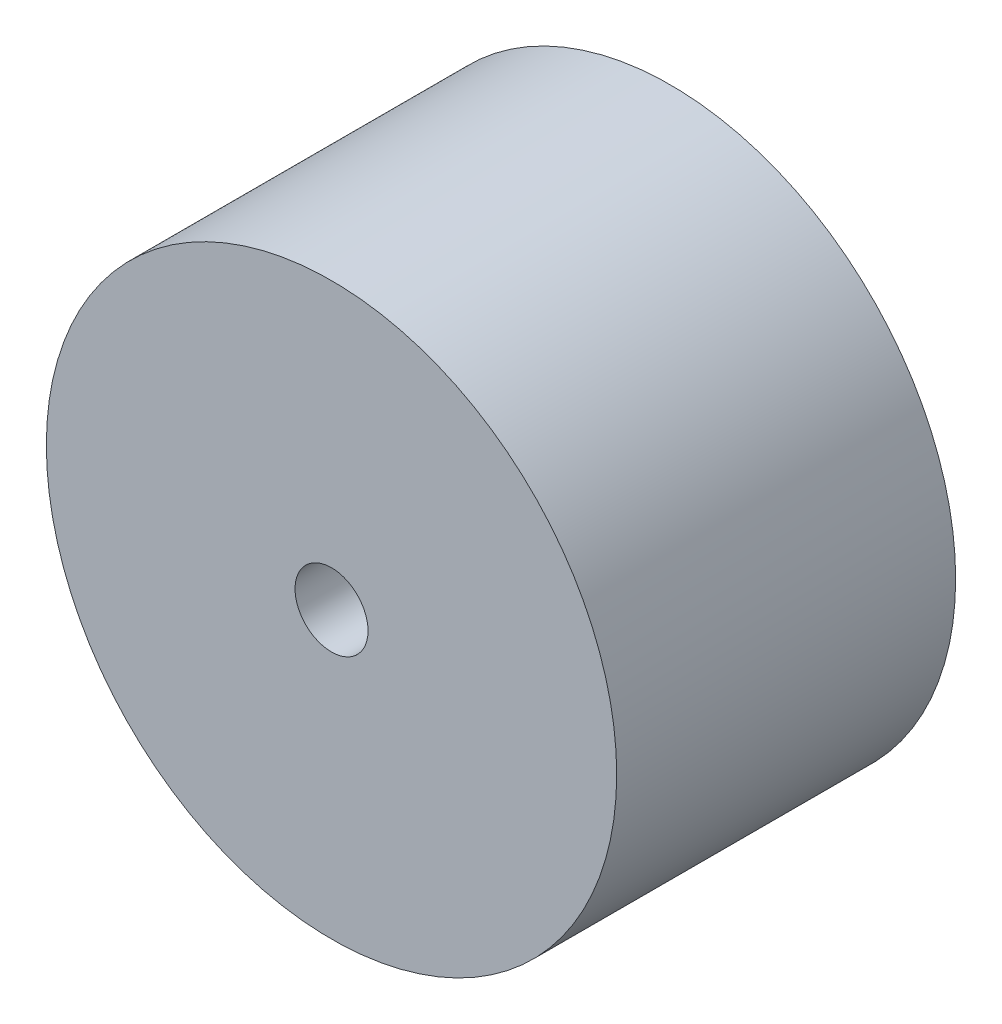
ISO-10303-21;
HEADER;
FILE_DESCRIPTION(('STEP AP214'),'2;1');
FILE_NAME('part.step','',(''),(''),'','','');
FILE_SCHEMA(('AUTOMOTIVE_DESIGN { 1 0 10303 214 1 1 1 1 }'));
ENDSEC;
DATA;
#1=APPLICATION_CONTEXT('core data for automotive mechanical design processes');
#2=APPLICATION_PROTOCOL_DEFINITION('international standard','automotive_design',2000,#1);
#3=PRODUCT_CONTEXT('',#1,'mechanical');
#4=PRODUCT('Part','Part','',(#3));
#5=PRODUCT_RELATED_PRODUCT_CATEGORY('part','',(#4));
#6=PRODUCT_DEFINITION_FORMATION('','',#4);
#7=PRODUCT_DEFINITION_CONTEXT('part definition',#1,'design');
#8=PRODUCT_DEFINITION('design','',#6,#7);
#9=PRODUCT_DEFINITION_SHAPE('','',#8);
#10=(LENGTH_UNIT() NAMED_UNIT(*) SI_UNIT(.MILLI.,.METRE.));
#11=(NAMED_UNIT(*) PLANE_ANGLE_UNIT() SI_UNIT($,.RADIAN.));
#12=(NAMED_UNIT(*) SI_UNIT($,.STERADIAN.) SOLID_ANGLE_UNIT());
#13=UNCERTAINTY_MEASURE_WITH_UNIT(LENGTH_MEASURE(1.E-05),#10,'distance_accuracy_value','');
#14=(GEOMETRIC_REPRESENTATION_CONTEXT(3) GLOBAL_UNCERTAINTY_ASSIGNED_CONTEXT((#13)) GLOBAL_UNIT_ASSIGNED_CONTEXT((#10,
#11,#12)) REPRESENTATION_CONTEXT('',''));
#15=CARTESIAN_POINT('',(0.,0.,0.));
#16=DIRECTION('',(0.,0.,1.));
#17=DIRECTION('',(1.,0.,0.));
#18=AXIS2_PLACEMENT_3D('',#15,#16,#17);
#19=CARTESIAN_POINT('',(0.,0.,29.7137));
#20=DIRECTION('',(0.,0.,1.));
#21=DIRECTION('',(1.,0.,0.));
#22=AXIS2_PLACEMENT_3D('',#19,#20,#21);
#23=PLANE('',#22);
#24=CARTESIAN_POINT('',(0.,0.,29.7137));
#25=DIRECTION('',(0.,0.,1.));
#26=DIRECTION('',(1.,0.,0.));
#27=AXIS2_PLACEMENT_3D('',#24,#25,#26);
#28=CIRCLE('',#27,25.);
#29=CARTESIAN_POINT('',(25.,0.,29.7137));
#30=VERTEX_POINT('',#29);
#31=EDGE_CURVE('E10',#30,#30,#28,.T.);
#32=ORIENTED_EDGE('',*,*,#31,.T.);
#33=EDGE_LOOP('',(#32));
#34=FACE_BOUND('',#33,.T.);
#35=CARTESIAN_POINT('',(0.,0.,29.7137));
#36=DIRECTION('',(0.,0.,1.));
#37=DIRECTION('',(1.,0.,0.));
#38=AXIS2_PLACEMENT_3D('',#35,#36,#37);
#39=CIRCLE('',#38,3.2);
#40=CARTESIAN_POINT('',(3.2,0.,29.7137));
#41=VERTEX_POINT('',#40);
#42=EDGE_CURVE('E50',#41,#41,#39,.T.);
#43=ORIENTED_EDGE('',*,*,#42,.F.);
#44=EDGE_LOOP('',(#43));
#45=FACE_BOUND('',#44,.T.);
#46=ADVANCED_FACE('F39',(#34,#45),#23,.T.);
#47=CARTESIAN_POINT('',(0.,0.,0.));
#48=DIRECTION('',(0.,0.,1.));
#49=DIRECTION('',(1.,0.,0.));
#50=AXIS2_PLACEMENT_3D('',#47,#48,#49);
#51=PLANE('',#50);
#52=CARTESIAN_POINT('',(0.,0.,0.));
#53=DIRECTION('',(0.,0.,1.));
#54=DIRECTION('',(1.,0.,0.));
#55=AXIS2_PLACEMENT_3D('',#52,#53,#54);
#56=CIRCLE('',#55,25.);
#57=CARTESIAN_POINT('',(25.,0.,0.));
#58=VERTEX_POINT('',#57);
#59=EDGE_CURVE('E43',#58,#58,#56,.T.);
#60=ORIENTED_EDGE('',*,*,#59,.F.);
#61=EDGE_LOOP('',(#60));
#62=FACE_BOUND('',#61,.T.);
#63=CARTESIAN_POINT('',(0.,0.,0.));
#64=DIRECTION('',(0.,0.,1.));
#65=DIRECTION('',(1.,0.,0.));
#66=AXIS2_PLACEMENT_3D('',#63,#64,#65);
#67=CIRCLE('',#66,3.2);
#68=CARTESIAN_POINT('',(3.2,0.,0.));
#69=VERTEX_POINT('',#68);
#70=EDGE_CURVE('E52',#69,#69,#67,.T.);
#71=ORIENTED_EDGE('',*,*,#70,.T.);
#72=EDGE_LOOP('',(#71));
#73=FACE_BOUND('',#72,.T.);
#74=ADVANCED_FACE('F62',(#62,#73),#51,.F.);
#75=CARTESIAN_POINT('',(0.,0.,29.7137));
#76=DIRECTION('',(0.,0.,-1.));
#77=DIRECTION('',(-1.,0.,0.));
#78=AXIS2_PLACEMENT_3D('',#75,#76,#77);
#79=CYLINDRICAL_SURFACE('',#78,25.);
#80=ORIENTED_EDGE('',*,*,#31,.F.);
#81=EDGE_LOOP('',(#80));
#82=FACE_BOUND('',#81,.T.);
#83=ORIENTED_EDGE('',*,*,#59,.T.);
#84=EDGE_LOOP('',(#83));
#85=FACE_BOUND('',#84,.T.);
#86=ADVANCED_FACE('F41',(#82,#85),#79,.T.);
#87=CARTESIAN_POINT('',(0.,0.,29.7137));
#88=DIRECTION('',(0.,0.,-1.));
#89=DIRECTION('',(-1.,0.,0.));
#90=AXIS2_PLACEMENT_3D('',#87,#88,#89);
#91=CYLINDRICAL_SURFACE('',#90,3.2);
#92=ORIENTED_EDGE('',*,*,#42,.T.);
#93=EDGE_LOOP('',(#92));
#94=FACE_BOUND('',#93,.T.);
#95=ORIENTED_EDGE('',*,*,#70,.F.);
#96=EDGE_LOOP('',(#95));
#97=FACE_BOUND('',#96,.T.);
#98=ADVANCED_FACE('F58',(#94,#97),#91,.F.);
#99=CLOSED_SHELL('',(#46,#74,#86,#98));
#100=MANIFOLD_SOLID_BREP('B2',#99);
#101=ADVANCED_BREP_SHAPE_REPRESENTATION('',(#18,#100),#14);
#102=SHAPE_DEFINITION_REPRESENTATION(#9,#101);
ENDSEC;
END-ISO-10303-21;
